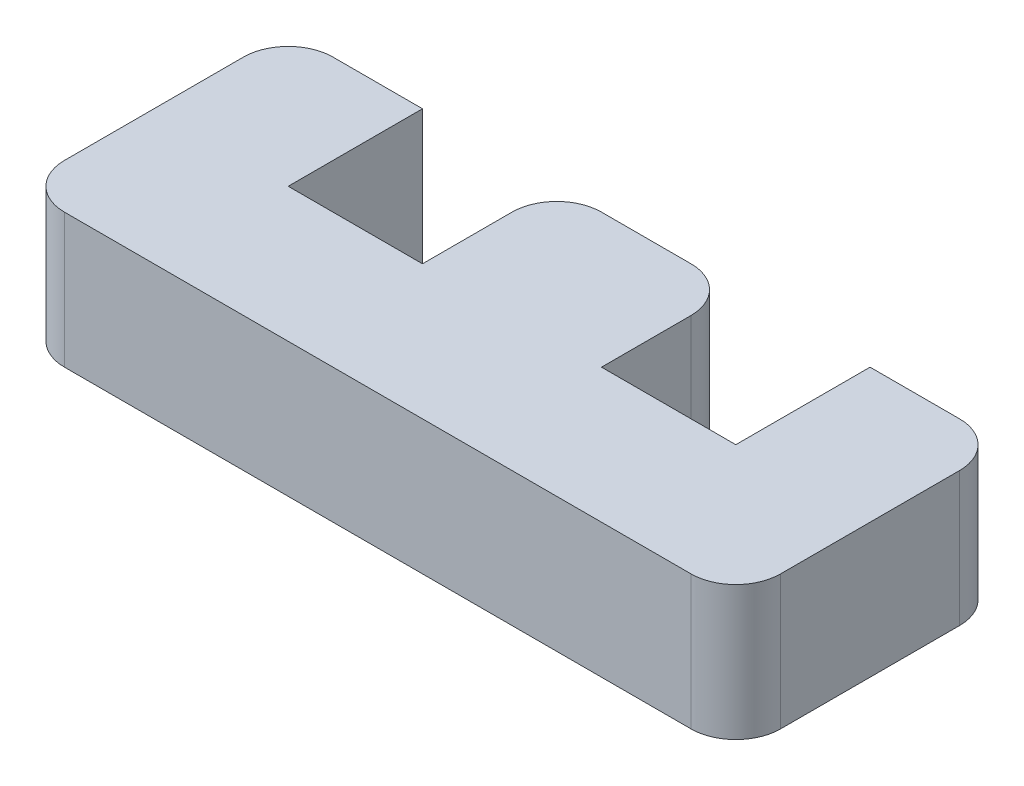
ISO-10303-21;
HEADER;
FILE_DESCRIPTION(('STEP AP214'),'2;1');
FILE_NAME('part.step','',(''),(''),'','','');
FILE_SCHEMA(('AUTOMOTIVE_DESIGN { 1 0 10303 214 1 1 1 1 }'));
ENDSEC;
DATA;
#1=APPLICATION_CONTEXT('core data for automotive mechanical design processes');
#2=APPLICATION_PROTOCOL_DEFINITION('international standard','automotive_design',2000,#1);
#3=PRODUCT_CONTEXT('',#1,'mechanical');
#4=PRODUCT('Part','Part','',(#3));
#5=PRODUCT_RELATED_PRODUCT_CATEGORY('part','',(#4));
#6=PRODUCT_DEFINITION_FORMATION('','',#4);
#7=PRODUCT_DEFINITION_CONTEXT('part definition',#1,'design');
#8=PRODUCT_DEFINITION('design','',#6,#7);
#9=PRODUCT_DEFINITION_SHAPE('','',#8);
#10=(LENGTH_UNIT() NAMED_UNIT(*) SI_UNIT(.MILLI.,.METRE.));
#11=(NAMED_UNIT(*) PLANE_ANGLE_UNIT() SI_UNIT($,.RADIAN.));
#12=(NAMED_UNIT(*) SI_UNIT($,.STERADIAN.) SOLID_ANGLE_UNIT());
#13=UNCERTAINTY_MEASURE_WITH_UNIT(LENGTH_MEASURE(1.E-05),#10,'distance_accuracy_value','');
#14=(GEOMETRIC_REPRESENTATION_CONTEXT(3) GLOBAL_UNCERTAINTY_ASSIGNED_CONTEXT((#13)) GLOBAL_UNIT_ASSIGNED_CONTEXT((#10,
#11,#12)) REPRESENTATION_CONTEXT('',''));
#15=CARTESIAN_POINT('',(0.,0.,0.));
#16=DIRECTION('',(0.,0.,1.));
#17=DIRECTION('',(1.,0.,0.));
#18=AXIS2_PLACEMENT_3D('',#15,#16,#17);
#19=CARTESIAN_POINT('',(3.,3.,0.));
#20=DIRECTION('',(0.,0.,1.));
#21=DIRECTION('',(1.,0.,0.));
#22=AXIS2_PLACEMENT_3D('',#19,#20,#21);
#23=PLANE('',#22);
#24=DIRECTION('',(-1.,0.,0.));
#25=VECTOR('',#24,1.);
#26=CARTESIAN_POINT('',(3.,0.,0.));
#27=LINE('',#26,#25);
#28=CARTESIAN_POINT('',(3.,0.,0.));
#29=VERTEX_POINT('',#28);
#30=CARTESIAN_POINT('',(1.,0.,0.));
#31=VERTEX_POINT('',#30);
#32=EDGE_CURVE('E196',#29,#31,#27,.T.);
#33=ORIENTED_EDGE('',*,*,#32,.T.);
#34=DIRECTION('',(0.,-1.,0.));
#35=VECTOR('',#34,1.);
#36=CARTESIAN_POINT('',(1.,3.,0.));
#37=LINE('',#36,#35);
#38=CARTESIAN_POINT('',(1.,3.,0.));
#39=VERTEX_POINT('',#38);
#40=EDGE_CURVE('E274',#31,#39,#37,.F.);
#41=ORIENTED_EDGE('',*,*,#40,.T.);
#42=DIRECTION('',(-1.,0.,0.));
#43=VECTOR('',#42,1.);
#44=CARTESIAN_POINT('',(3.,3.,0.));
#45=LINE('',#44,#43);
#46=CARTESIAN_POINT('',(3.,3.,0.));
#47=VERTEX_POINT('',#46);
#48=EDGE_CURVE('E225',#47,#39,#45,.T.);
#49=ORIENTED_EDGE('',*,*,#48,.F.);
#50=DIRECTION('',(0.,-1.,0.));
#51=VECTOR('',#50,1.);
#52=CARTESIAN_POINT('',(3.,3.,0.));
#53=LINE('',#52,#51);
#54=EDGE_CURVE('E195',#47,#29,#53,.T.);
#55=ORIENTED_EDGE('',*,*,#54,.T.);
#56=EDGE_LOOP('',(#33,#41,#49,#55));
#57=FACE_BOUND('',#56,.T.);
#58=ADVANCED_FACE('F33',(#57),#23,.F.);
#59=CARTESIAN_POINT('',(0.,3.,0.));
#60=DIRECTION('',(1.,0.,0.));
#61=DIRECTION('',(0.,0.,-1.));
#62=AXIS2_PLACEMENT_3D('',#59,#60,#61);
#63=PLANE('',#62);
#64=DIRECTION('',(0.,0.,1.));
#65=VECTOR('',#64,1.);
#66=CARTESIAN_POINT('',(0.,3.,0.));
#67=LINE('',#66,#65);
#68=CARTESIAN_POINT('',(0.,3.,1.));
#69=VERTEX_POINT('',#68);
#70=CARTESIAN_POINT('',(0.,3.,5.));
#71=VERTEX_POINT('',#70);
#72=EDGE_CURVE('E306',#69,#71,#67,.T.);
#73=ORIENTED_EDGE('',*,*,#72,.F.);
#74=DIRECTION('',(0.,-1.,0.));
#75=VECTOR('',#74,1.);
#76=CARTESIAN_POINT('',(0.,3.,1.));
#77=LINE('',#76,#75);
#78=CARTESIAN_POINT('',(0.,0.,1.));
#79=VERTEX_POINT('',#78);
#80=EDGE_CURVE('E271',#69,#79,#77,.T.);
#81=ORIENTED_EDGE('',*,*,#80,.T.);
#82=DIRECTION('',(0.,0.,1.));
#83=VECTOR('',#82,1.);
#84=CARTESIAN_POINT('',(0.,0.,0.));
#85=LINE('',#84,#83);
#86=CARTESIAN_POINT('',(0.,0.,5.));
#87=VERTEX_POINT('',#86);
#88=EDGE_CURVE('E199',#79,#87,#85,.T.);
#89=ORIENTED_EDGE('',*,*,#88,.T.);
#90=DIRECTION('',(0.,-1.,0.));
#91=VECTOR('',#90,1.);
#92=CARTESIAN_POINT('',(0.,3.,5.));
#93=LINE('',#92,#91);
#94=EDGE_CURVE('E269',#87,#71,#93,.F.);
#95=ORIENTED_EDGE('',*,*,#94,.T.);
#96=EDGE_LOOP('',(#73,#81,#89,#95));
#97=FACE_BOUND('',#96,.T.);
#98=ADVANCED_FACE('F323',(#97),#63,.F.);
#99=CARTESIAN_POINT('',(0.,3.,6.));
#100=DIRECTION('',(0.,0.,-1.));
#101=DIRECTION('',(-1.,0.,0.));
#102=AXIS2_PLACEMENT_3D('',#99,#100,#101);
#103=PLANE('',#102);
#104=DIRECTION('',(1.,0.,0.));
#105=VECTOR('',#104,1.);
#106=CARTESIAN_POINT('',(0.,0.,6.));
#107=LINE('',#106,#105);
#108=CARTESIAN_POINT('',(1.,0.,6.));
#109=VERTEX_POINT('',#108);
#110=CARTESIAN_POINT('',(15.,0.,6.));
#111=VERTEX_POINT('',#110);
#112=EDGE_CURVE('E202',#109,#111,#107,.T.);
#113=ORIENTED_EDGE('',*,*,#112,.T.);
#114=DIRECTION('',(0.,-1.,0.));
#115=VECTOR('',#114,1.);
#116=CARTESIAN_POINT('',(15.,3.,6.));
#117=LINE('',#116,#115);
#118=CARTESIAN_POINT('',(15.,3.,6.));
#119=VERTEX_POINT('',#118);
#120=EDGE_CURVE('E11',#111,#119,#117,.F.);
#121=ORIENTED_EDGE('',*,*,#120,.T.);
#122=DIRECTION('',(1.,0.,0.));
#123=VECTOR('',#122,1.);
#124=CARTESIAN_POINT('',(0.,3.,6.));
#125=LINE('',#124,#123);
#126=CARTESIAN_POINT('',(1.,3.,6.));
#127=VERTEX_POINT('',#126);
#128=EDGE_CURVE('E290',#127,#119,#125,.T.);
#129=ORIENTED_EDGE('',*,*,#128,.F.);
#130=DIRECTION('',(0.,-1.,0.));
#131=VECTOR('',#130,1.);
#132=CARTESIAN_POINT('',(1.,3.,6.));
#133=LINE('',#132,#131);
#134=EDGE_CURVE('E41',#127,#109,#133,.T.);
#135=ORIENTED_EDGE('',*,*,#134,.T.);
#136=EDGE_LOOP('',(#113,#121,#129,#135));
#137=FACE_BOUND('',#136,.T.);
#138=ADVANCED_FACE('F287',(#137),#103,.F.);
#139=CARTESIAN_POINT('',(16.,3.,6.));
#140=DIRECTION('',(-1.,0.,0.));
#141=DIRECTION('',(0.,0.,1.));
#142=AXIS2_PLACEMENT_3D('',#139,#140,#141);
#143=PLANE('',#142);
#144=DIRECTION('',(0.,0.,-1.));
#145=VECTOR('',#144,1.);
#146=CARTESIAN_POINT('',(16.,0.,6.));
#147=LINE('',#146,#145);
#148=CARTESIAN_POINT('',(16.,0.,5.));
#149=VERTEX_POINT('',#148);
#150=CARTESIAN_POINT('',(16.,0.,1.));
#151=VERTEX_POINT('',#150);
#152=EDGE_CURVE('E205',#149,#151,#147,.T.);
#153=ORIENTED_EDGE('',*,*,#152,.T.);
#154=DIRECTION('',(0.,-1.,0.));
#155=VECTOR('',#154,1.);
#156=CARTESIAN_POINT('',(16.,3.,1.));
#157=LINE('',#156,#155);
#158=CARTESIAN_POINT('',(16.,3.,1.));
#159=VERTEX_POINT('',#158);
#160=EDGE_CURVE('E281',#151,#159,#157,.F.);
#161=ORIENTED_EDGE('',*,*,#160,.T.);
#162=DIRECTION('',(0.,0.,-1.));
#163=VECTOR('',#162,1.);
#164=CARTESIAN_POINT('',(16.,3.,6.));
#165=LINE('',#164,#163);
#166=CARTESIAN_POINT('',(16.,3.,5.));
#167=VERTEX_POINT('',#166);
#168=EDGE_CURVE('E165',#167,#159,#165,.T.);
#169=ORIENTED_EDGE('',*,*,#168,.F.);
#170=DIRECTION('',(0.,-1.,0.));
#171=VECTOR('',#170,1.);
#172=CARTESIAN_POINT('',(16.,3.,5.));
#173=LINE('',#172,#171);
#174=EDGE_CURVE('E278',#167,#149,#173,.T.);
#175=ORIENTED_EDGE('',*,*,#174,.T.);
#176=EDGE_LOOP('',(#153,#161,#169,#175));
#177=FACE_BOUND('',#176,.T.);
#178=ADVANCED_FACE('F304',(#177),#143,.F.);
#179=CARTESIAN_POINT('',(16.,3.,0.));
#180=DIRECTION('',(0.,0.,1.));
#181=DIRECTION('',(1.,0.,0.));
#182=AXIS2_PLACEMENT_3D('',#179,#180,#181);
#183=PLANE('',#182);
#184=DIRECTION('',(-1.,0.,0.));
#185=VECTOR('',#184,1.);
#186=CARTESIAN_POINT('',(16.,3.,0.));
#187=LINE('',#186,#185);
#188=CARTESIAN_POINT('',(15.,3.,0.));
#189=VERTEX_POINT('',#188);
#190=CARTESIAN_POINT('',(13.,3.,0.));
#191=VERTEX_POINT('',#190);
#192=EDGE_CURVE('E155',#189,#191,#187,.T.);
#193=ORIENTED_EDGE('',*,*,#192,.F.);
#194=DIRECTION('',(0.,-1.,0.));
#195=VECTOR('',#194,1.);
#196=CARTESIAN_POINT('',(15.,3.,0.));
#197=LINE('',#196,#195);
#198=CARTESIAN_POINT('',(15.,0.,0.));
#199=VERTEX_POINT('',#198);
#200=EDGE_CURVE('E276',#189,#199,#197,.T.);
#201=ORIENTED_EDGE('',*,*,#200,.T.);
#202=DIRECTION('',(-1.,0.,0.));
#203=VECTOR('',#202,1.);
#204=CARTESIAN_POINT('',(16.,0.,0.));
#205=LINE('',#204,#203);
#206=CARTESIAN_POINT('',(13.,0.,0.));
#207=VERTEX_POINT('',#206);
#208=EDGE_CURVE('E171',#199,#207,#205,.T.);
#209=ORIENTED_EDGE('',*,*,#208,.T.);
#210=DIRECTION('',(0.,-1.,0.));
#211=VECTOR('',#210,1.);
#212=CARTESIAN_POINT('',(13.,3.,0.));
#213=LINE('',#212,#211);
#214=EDGE_CURVE('E168',#191,#207,#213,.T.);
#215=ORIENTED_EDGE('',*,*,#214,.F.);
#216=EDGE_LOOP('',(#193,#201,#209,#215));
#217=FACE_BOUND('',#216,.T.);
#218=ADVANCED_FACE('F169',(#217),#183,.F.);
#219=CARTESIAN_POINT('',(13.,3.,0.));
#220=DIRECTION('',(1.,0.,0.));
#221=DIRECTION('',(0.,0.,-1.));
#222=AXIS2_PLACEMENT_3D('',#219,#220,#221);
#223=PLANE('',#222);
#224=DIRECTION('',(0.,0.,1.));
#225=VECTOR('',#224,1.);
#226=CARTESIAN_POINT('',(13.,0.,0.));
#227=LINE('',#226,#225);
#228=CARTESIAN_POINT('',(13.,0.,3.));
#229=VERTEX_POINT('',#228);
#230=EDGE_CURVE('E209',#207,#229,#227,.T.);
#231=ORIENTED_EDGE('',*,*,#230,.T.);
#232=DIRECTION('',(0.,-1.,0.));
#233=VECTOR('',#232,1.);
#234=CARTESIAN_POINT('',(13.,3.,3.));
#235=LINE('',#234,#233);
#236=CARTESIAN_POINT('',(13.,3.,3.));
#237=VERTEX_POINT('',#236);
#238=EDGE_CURVE('E175',#237,#229,#235,.T.);
#239=ORIENTED_EDGE('',*,*,#238,.F.);
#240=DIRECTION('',(0.,0.,1.));
#241=VECTOR('',#240,1.);
#242=CARTESIAN_POINT('',(13.,3.,0.));
#243=LINE('',#242,#241);
#244=EDGE_CURVE('E160',#191,#237,#243,.T.);
#245=ORIENTED_EDGE('',*,*,#244,.F.);
#246=ORIENTED_EDGE('',*,*,#214,.T.);
#247=EDGE_LOOP('',(#231,#239,#245,#246));
#248=FACE_BOUND('',#247,.T.);
#249=ADVANCED_FACE('F177',(#248),#223,.F.);
#250=CARTESIAN_POINT('',(13.,3.,3.));
#251=DIRECTION('',(0.,0.,1.));
#252=DIRECTION('',(1.,0.,0.));
#253=AXIS2_PLACEMENT_3D('',#250,#251,#252);
#254=PLANE('',#253);
#255=DIRECTION('',(-1.,0.,0.));
#256=VECTOR('',#255,1.);
#257=CARTESIAN_POINT('',(13.,0.,3.));
#258=LINE('',#257,#256);
#259=CARTESIAN_POINT('',(10.,0.,3.));
#260=VERTEX_POINT('',#259);
#261=EDGE_CURVE('E211',#229,#260,#258,.T.);
#262=ORIENTED_EDGE('',*,*,#261,.T.);
#263=DIRECTION('',(0.,-1.,0.));
#264=VECTOR('',#263,1.);
#265=CARTESIAN_POINT('',(10.,3.,3.));
#266=LINE('',#265,#264);
#267=CARTESIAN_POINT('',(10.,3.,3.));
#268=VERTEX_POINT('',#267);
#269=EDGE_CURVE('E234',#268,#260,#266,.T.);
#270=ORIENTED_EDGE('',*,*,#269,.F.);
#271=DIRECTION('',(-1.,0.,0.));
#272=VECTOR('',#271,1.);
#273=CARTESIAN_POINT('',(13.,3.,3.));
#274=LINE('',#273,#272);
#275=EDGE_CURVE('E180',#237,#268,#274,.T.);
#276=ORIENTED_EDGE('',*,*,#275,.F.);
#277=ORIENTED_EDGE('',*,*,#238,.T.);
#278=EDGE_LOOP('',(#262,#270,#276,#277));
#279=FACE_BOUND('',#278,.T.);
#280=ADVANCED_FACE('F357',(#279),#254,.F.);
#281=CARTESIAN_POINT('',(10.,3.,3.));
#282=DIRECTION('',(-1.,0.,0.));
#283=DIRECTION('',(0.,0.,1.));
#284=AXIS2_PLACEMENT_3D('',#281,#282,#283);
#285=PLANE('',#284);
#286=DIRECTION('',(0.,0.,-1.));
#287=VECTOR('',#286,1.);
#288=CARTESIAN_POINT('',(10.,0.,3.));
#289=LINE('',#288,#287);
#290=CARTESIAN_POINT('',(10.,0.,1.));
#291=VERTEX_POINT('',#290);
#292=EDGE_CURVE('E213',#260,#291,#289,.T.);
#293=ORIENTED_EDGE('',*,*,#292,.T.);
#294=DIRECTION('',(0.,-1.,0.));
#295=VECTOR('',#294,1.);
#296=CARTESIAN_POINT('',(10.,3.,1.));
#297=LINE('',#296,#295);
#298=CARTESIAN_POINT('',(10.,3.,1.));
#299=VERTEX_POINT('',#298);
#300=EDGE_CURVE('E254',#291,#299,#297,.F.);
#301=ORIENTED_EDGE('',*,*,#300,.T.);
#302=DIRECTION('',(0.,0.,-1.));
#303=VECTOR('',#302,1.);
#304=CARTESIAN_POINT('',(10.,3.,3.));
#305=LINE('',#304,#303);
#306=EDGE_CURVE('E182',#268,#299,#305,.T.);
#307=ORIENTED_EDGE('',*,*,#306,.F.);
#308=ORIENTED_EDGE('',*,*,#269,.T.);
#309=EDGE_LOOP('',(#293,#301,#307,#308));
#310=FACE_BOUND('',#309,.T.);
#311=ADVANCED_FACE('F353',(#310),#285,.F.);
#312=CARTESIAN_POINT('',(10.,3.,0.));
#313=DIRECTION('',(0.,0.,1.));
#314=DIRECTION('',(1.,0.,0.));
#315=AXIS2_PLACEMENT_3D('',#312,#313,#314);
#316=PLANE('',#315);
#317=DIRECTION('',(-1.,0.,0.));
#318=VECTOR('',#317,1.);
#319=CARTESIAN_POINT('',(10.,3.,0.));
#320=LINE('',#319,#318);
#321=CARTESIAN_POINT('',(9.,3.,0.));
#322=VERTEX_POINT('',#321);
#323=CARTESIAN_POINT('',(7.,3.,0.));
#324=VERTEX_POINT('',#323);
#325=EDGE_CURVE('E187',#322,#324,#320,.T.);
#326=ORIENTED_EDGE('',*,*,#325,.F.);
#327=DIRECTION('',(0.,-1.,0.));
#328=VECTOR('',#327,1.);
#329=CARTESIAN_POINT('',(9.,3.,0.));
#330=LINE('',#329,#328);
#331=CARTESIAN_POINT('',(9.,0.,0.));
#332=VERTEX_POINT('',#331);
#333=EDGE_CURVE('E239',#322,#332,#330,.T.);
#334=ORIENTED_EDGE('',*,*,#333,.T.);
#335=DIRECTION('',(-1.,0.,0.));
#336=VECTOR('',#335,1.);
#337=CARTESIAN_POINT('',(10.,0.,0.));
#338=LINE('',#337,#336);
#339=CARTESIAN_POINT('',(7.,0.,0.));
#340=VERTEX_POINT('',#339);
#341=EDGE_CURVE('E216',#332,#340,#338,.T.);
#342=ORIENTED_EDGE('',*,*,#341,.T.);
#343=DIRECTION('',(0.,-1.,0.));
#344=VECTOR('',#343,1.);
#345=CARTESIAN_POINT('',(7.,3.,0.));
#346=LINE('',#345,#344);
#347=EDGE_CURVE('E174',#340,#324,#346,.F.);
#348=ORIENTED_EDGE('',*,*,#347,.T.);
#349=EDGE_LOOP('',(#326,#334,#342,#348));
#350=FACE_BOUND('',#349,.T.);
#351=ADVANCED_FACE('F344',(#350),#316,.F.);
#352=CARTESIAN_POINT('',(6.,3.,0.));
#353=DIRECTION('',(1.,0.,0.));
#354=DIRECTION('',(0.,0.,-1.));
#355=AXIS2_PLACEMENT_3D('',#352,#353,#354);
#356=PLANE('',#355);
#357=DIRECTION('',(0.,0.,1.));
#358=VECTOR('',#357,1.);
#359=CARTESIAN_POINT('',(6.,3.,0.));
#360=LINE('',#359,#358);
#361=CARTESIAN_POINT('',(6.,3.,1.));
#362=VERTEX_POINT('',#361);
#363=CARTESIAN_POINT('',(6.,3.,3.));
#364=VERTEX_POINT('',#363);
#365=EDGE_CURVE('E189',#362,#364,#360,.T.);
#366=ORIENTED_EDGE('',*,*,#365,.F.);
#367=DIRECTION('',(0.,-1.,0.));
#368=VECTOR('',#367,1.);
#369=CARTESIAN_POINT('',(6.,3.,1.));
#370=LINE('',#369,#368);
#371=CARTESIAN_POINT('',(6.,0.,1.));
#372=VERTEX_POINT('',#371);
#373=EDGE_CURVE('E266',#362,#372,#370,.T.);
#374=ORIENTED_EDGE('',*,*,#373,.T.);
#375=DIRECTION('',(0.,0.,1.));
#376=VECTOR('',#375,1.);
#377=CARTESIAN_POINT('',(6.,0.,0.));
#378=LINE('',#377,#376);
#379=CARTESIAN_POINT('',(6.,0.,3.));
#380=VERTEX_POINT('',#379);
#381=EDGE_CURVE('E219',#372,#380,#378,.T.);
#382=ORIENTED_EDGE('',*,*,#381,.T.);
#383=DIRECTION('',(0.,-1.,0.));
#384=VECTOR('',#383,1.);
#385=CARTESIAN_POINT('',(6.,3.,3.));
#386=LINE('',#385,#384);
#387=EDGE_CURVE('E231',#364,#380,#386,.T.);
#388=ORIENTED_EDGE('',*,*,#387,.F.);
#389=EDGE_LOOP('',(#366,#374,#382,#388));
#390=FACE_BOUND('',#389,.T.);
#391=ADVANCED_FACE('F337',(#390),#356,.F.);
#392=CARTESIAN_POINT('',(6.,3.,3.));
#393=DIRECTION('',(0.,0.,1.));
#394=DIRECTION('',(1.,0.,0.));
#395=AXIS2_PLACEMENT_3D('',#392,#393,#394);
#396=PLANE('',#395);
#397=DIRECTION('',(-1.,0.,0.));
#398=VECTOR('',#397,1.);
#399=CARTESIAN_POINT('',(6.,0.,3.));
#400=LINE('',#399,#398);
#401=CARTESIAN_POINT('',(3.,0.,3.));
#402=VERTEX_POINT('',#401);
#403=EDGE_CURVE('E221',#380,#402,#400,.T.);
#404=ORIENTED_EDGE('',*,*,#403,.T.);
#405=DIRECTION('',(0.,-1.,0.));
#406=VECTOR('',#405,1.);
#407=CARTESIAN_POINT('',(3.,3.,3.));
#408=LINE('',#407,#406);
#409=CARTESIAN_POINT('',(3.,3.,3.));
#410=VERTEX_POINT('',#409);
#411=EDGE_CURVE('E228',#410,#402,#408,.T.);
#412=ORIENTED_EDGE('',*,*,#411,.F.);
#413=DIRECTION('',(-1.,0.,0.));
#414=VECTOR('',#413,1.);
#415=CARTESIAN_POINT('',(6.,3.,3.));
#416=LINE('',#415,#414);
#417=EDGE_CURVE('E191',#364,#410,#416,.T.);
#418=ORIENTED_EDGE('',*,*,#417,.F.);
#419=ORIENTED_EDGE('',*,*,#387,.T.);
#420=EDGE_LOOP('',(#404,#412,#418,#419));
#421=FACE_BOUND('',#420,.T.);
#422=ADVANCED_FACE('F333',(#421),#396,.F.);
#423=CARTESIAN_POINT('',(3.,3.,3.));
#424=DIRECTION('',(-1.,0.,0.));
#425=DIRECTION('',(0.,0.,1.));
#426=AXIS2_PLACEMENT_3D('',#423,#424,#425);
#427=PLANE('',#426);
#428=DIRECTION('',(0.,0.,-1.));
#429=VECTOR('',#428,1.);
#430=CARTESIAN_POINT('',(3.,0.,3.));
#431=LINE('',#430,#429);
#432=EDGE_CURVE('E223',#402,#29,#431,.T.);
#433=ORIENTED_EDGE('',*,*,#432,.T.);
#434=ORIENTED_EDGE('',*,*,#54,.F.);
#435=DIRECTION('',(0.,0.,-1.));
#436=VECTOR('',#435,1.);
#437=CARTESIAN_POINT('',(3.,3.,3.));
#438=LINE('',#437,#436);
#439=EDGE_CURVE('E193',#410,#47,#438,.T.);
#440=ORIENTED_EDGE('',*,*,#439,.F.);
#441=ORIENTED_EDGE('',*,*,#411,.T.);
#442=EDGE_LOOP('',(#433,#434,#440,#441));
#443=FACE_BOUND('',#442,.T.);
#444=ADVANCED_FACE('F328',(#443),#427,.F.);
#445=CARTESIAN_POINT('',(0.,3.,0.));
#446=DIRECTION('',(0.,1.,0.));
#447=DIRECTION('',(0.,0.,1.));
#448=AXIS2_PLACEMENT_3D('',#445,#446,#447);
#449=PLANE('',#448);
#450=ORIENTED_EDGE('',*,*,#306,.T.);
#451=CARTESIAN_POINT('',(9.,3.,1.));
#452=DIRECTION('',(0.,1.,0.));
#453=DIRECTION('',(0.,0.,1.));
#454=AXIS2_PLACEMENT_3D('',#451,#452,#453);
#455=CIRCLE('',#454,1.);
#456=EDGE_CURVE('E264',#299,#322,#455,.T.);
#457=ORIENTED_EDGE('',*,*,#456,.T.);
#458=ORIENTED_EDGE('',*,*,#325,.T.);
#459=CARTESIAN_POINT('',(7.,3.,1.));
#460=DIRECTION('',(0.,1.,0.));
#461=DIRECTION('',(0.,0.,1.));
#462=AXIS2_PLACEMENT_3D('',#459,#460,#461);
#463=CIRCLE('',#462,1.);
#464=EDGE_CURVE('E48',#324,#362,#463,.T.);
#465=ORIENTED_EDGE('',*,*,#464,.T.);
#466=ORIENTED_EDGE('',*,*,#365,.T.);
#467=ORIENTED_EDGE('',*,*,#417,.T.);
#468=ORIENTED_EDGE('',*,*,#439,.T.);
#469=ORIENTED_EDGE('',*,*,#48,.T.);
#470=CARTESIAN_POINT('',(1.,3.,1.));
#471=DIRECTION('',(0.,1.,0.));
#472=DIRECTION('',(0.,0.,1.));
#473=AXIS2_PLACEMENT_3D('',#470,#471,#472);
#474=CIRCLE('',#473,1.);
#475=EDGE_CURVE('E261',#39,#69,#474,.T.);
#476=ORIENTED_EDGE('',*,*,#475,.T.);
#477=ORIENTED_EDGE('',*,*,#72,.T.);
#478=CARTESIAN_POINT('',(1.,3.,5.));
#479=DIRECTION('',(0.,1.,0.));
#480=DIRECTION('',(0.,0.,1.));
#481=AXIS2_PLACEMENT_3D('',#478,#479,#480);
#482=CIRCLE('',#481,1.);
#483=EDGE_CURVE('E256',#71,#127,#482,.T.);
#484=ORIENTED_EDGE('',*,*,#483,.T.);
#485=ORIENTED_EDGE('',*,*,#128,.T.);
#486=CARTESIAN_POINT('',(15.,3.,5.));
#487=DIRECTION('',(0.,1.,0.));
#488=DIRECTION('',(0.,0.,1.));
#489=AXIS2_PLACEMENT_3D('',#486,#487,#488);
#490=CIRCLE('',#489,1.);
#491=EDGE_CURVE('E258',#119,#167,#490,.T.);
#492=ORIENTED_EDGE('',*,*,#491,.T.);
#493=ORIENTED_EDGE('',*,*,#168,.T.);
#494=CARTESIAN_POINT('',(15.,3.,1.));
#495=DIRECTION('',(0.,1.,0.));
#496=DIRECTION('',(0.,0.,1.));
#497=AXIS2_PLACEMENT_3D('',#494,#495,#496);
#498=CIRCLE('',#497,1.);
#499=EDGE_CURVE('E55',#159,#189,#498,.T.);
#500=ORIENTED_EDGE('',*,*,#499,.T.);
#501=ORIENTED_EDGE('',*,*,#192,.T.);
#502=ORIENTED_EDGE('',*,*,#244,.T.);
#503=ORIENTED_EDGE('',*,*,#275,.T.);
#504=EDGE_LOOP('',(#450,#457,#458,#465,#466,#467,#468,#469,#476,#477,#484,#485,#492,#493,#500,
#501,#502,#503));
#505=FACE_BOUND('',#504,.T.);
#506=ADVANCED_FACE('F158',(#505),#449,.T.);
#507=CARTESIAN_POINT('',(0.,0.,0.));
#508=DIRECTION('',(0.,1.,0.));
#509=DIRECTION('',(0.,0.,1.));
#510=AXIS2_PLACEMENT_3D('',#507,#508,#509);
#511=PLANE('',#510);
#512=ORIENTED_EDGE('',*,*,#341,.F.);
#513=CARTESIAN_POINT('',(9.,0.,1.));
#514=DIRECTION('',(0.,1.,0.));
#515=DIRECTION('',(0.,0.,1.));
#516=AXIS2_PLACEMENT_3D('',#513,#514,#515);
#517=CIRCLE('',#516,1.);
#518=EDGE_CURVE('E252',#332,#291,#517,.F.);
#519=ORIENTED_EDGE('',*,*,#518,.T.);
#520=ORIENTED_EDGE('',*,*,#292,.F.);
#521=ORIENTED_EDGE('',*,*,#261,.F.);
#522=ORIENTED_EDGE('',*,*,#230,.F.);
#523=ORIENTED_EDGE('',*,*,#208,.F.);
#524=CARTESIAN_POINT('',(15.,0.,1.));
#525=DIRECTION('',(0.,1.,0.));
#526=DIRECTION('',(0.,0.,1.));
#527=AXIS2_PLACEMENT_3D('',#524,#525,#526);
#528=CIRCLE('',#527,1.);
#529=EDGE_CURVE('E246',#199,#151,#528,.F.);
#530=ORIENTED_EDGE('',*,*,#529,.T.);
#531=ORIENTED_EDGE('',*,*,#152,.F.);
#532=CARTESIAN_POINT('',(15.,0.,5.));
#533=DIRECTION('',(0.,1.,0.));
#534=DIRECTION('',(0.,0.,1.));
#535=AXIS2_PLACEMENT_3D('',#532,#533,#534);
#536=CIRCLE('',#535,1.);
#537=EDGE_CURVE('E244',#149,#111,#536,.F.);
#538=ORIENTED_EDGE('',*,*,#537,.T.);
#539=ORIENTED_EDGE('',*,*,#112,.F.);
#540=CARTESIAN_POINT('',(1.,0.,5.));
#541=DIRECTION('',(0.,1.,0.));
#542=DIRECTION('',(0.,0.,1.));
#543=AXIS2_PLACEMENT_3D('',#540,#541,#542);
#544=CIRCLE('',#543,1.);
#545=EDGE_CURVE('E242',#109,#87,#544,.F.);
#546=ORIENTED_EDGE('',*,*,#545,.T.);
#547=ORIENTED_EDGE('',*,*,#88,.F.);
#548=CARTESIAN_POINT('',(1.,0.,1.));
#549=DIRECTION('',(0.,1.,0.));
#550=DIRECTION('',(0.,0.,1.));
#551=AXIS2_PLACEMENT_3D('',#548,#549,#550);
#552=CIRCLE('',#551,1.);
#553=EDGE_CURVE('E248',#79,#31,#552,.F.);
#554=ORIENTED_EDGE('',*,*,#553,.T.);
#555=ORIENTED_EDGE('',*,*,#32,.F.);
#556=ORIENTED_EDGE('',*,*,#432,.F.);
#557=ORIENTED_EDGE('',*,*,#403,.F.);
#558=ORIENTED_EDGE('',*,*,#381,.F.);
#559=CARTESIAN_POINT('',(7.,0.,1.));
#560=DIRECTION('',(0.,1.,0.));
#561=DIRECTION('',(0.,0.,1.));
#562=AXIS2_PLACEMENT_3D('',#559,#560,#561);
#563=CIRCLE('',#562,1.);
#564=EDGE_CURVE('E250',#372,#340,#563,.F.);
#565=ORIENTED_EDGE('',*,*,#564,.T.);
#566=EDGE_LOOP('',(#512,#519,#520,#521,#522,#523,#530,#531,#538,#539,#546,#547,#554,#555,#556,
#557,#558,#565));
#567=FACE_BOUND('',#566,.T.);
#568=ADVANCED_FACE('F295',(#567),#511,.F.);
#569=CARTESIAN_POINT('',(9.,3.,1.));
#570=DIRECTION('',(0.,-1.,0.));
#571=DIRECTION('',(0.,0.,-1.));
#572=AXIS2_PLACEMENT_3D('',#569,#570,#571);
#573=CYLINDRICAL_SURFACE('',#572,1.);
#574=ORIENTED_EDGE('',*,*,#456,.F.);
#575=ORIENTED_EDGE('',*,*,#300,.F.);
#576=ORIENTED_EDGE('',*,*,#518,.F.);
#577=ORIENTED_EDGE('',*,*,#333,.F.);
#578=EDGE_LOOP('',(#574,#575,#576,#577));
#579=FACE_BOUND('',#578,.T.);
#580=ADVANCED_FACE('F348',(#579),#573,.T.);
#581=CARTESIAN_POINT('',(7.,3.,1.));
#582=DIRECTION('',(0.,-1.,0.));
#583=DIRECTION('',(0.,0.,-1.));
#584=AXIS2_PLACEMENT_3D('',#581,#582,#583);
#585=CYLINDRICAL_SURFACE('',#584,1.);
#586=ORIENTED_EDGE('',*,*,#464,.F.);
#587=ORIENTED_EDGE('',*,*,#347,.F.);
#588=ORIENTED_EDGE('',*,*,#564,.F.);
#589=ORIENTED_EDGE('',*,*,#373,.F.);
#590=EDGE_LOOP('',(#586,#587,#588,#589));
#591=FACE_BOUND('',#590,.T.);
#592=ADVANCED_FACE('F340',(#591),#585,.T.);
#593=CARTESIAN_POINT('',(1.,3.,1.));
#594=DIRECTION('',(0.,-1.,0.));
#595=DIRECTION('',(0.,0.,-1.));
#596=AXIS2_PLACEMENT_3D('',#593,#594,#595);
#597=CYLINDRICAL_SURFACE('',#596,1.);
#598=ORIENTED_EDGE('',*,*,#475,.F.);
#599=ORIENTED_EDGE('',*,*,#40,.F.);
#600=ORIENTED_EDGE('',*,*,#553,.F.);
#601=ORIENTED_EDGE('',*,*,#80,.F.);
#602=EDGE_LOOP('',(#598,#599,#600,#601));
#603=FACE_BOUND('',#602,.T.);
#604=ADVANCED_FACE('F321',(#603),#597,.T.);
#605=CARTESIAN_POINT('',(15.,3.,1.));
#606=DIRECTION('',(0.,-1.,0.));
#607=DIRECTION('',(0.,0.,-1.));
#608=AXIS2_PLACEMENT_3D('',#605,#606,#607);
#609=CYLINDRICAL_SURFACE('',#608,1.);
#610=ORIENTED_EDGE('',*,*,#499,.F.);
#611=ORIENTED_EDGE('',*,*,#160,.F.);
#612=ORIENTED_EDGE('',*,*,#529,.F.);
#613=ORIENTED_EDGE('',*,*,#200,.F.);
#614=EDGE_LOOP('',(#610,#611,#612,#613));
#615=FACE_BOUND('',#614,.T.);
#616=ADVANCED_FACE('F359',(#615),#609,.T.);
#617=CARTESIAN_POINT('',(15.,3.,5.));
#618=DIRECTION('',(0.,-1.,0.));
#619=DIRECTION('',(0.,0.,-1.));
#620=AXIS2_PLACEMENT_3D('',#617,#618,#619);
#621=CYLINDRICAL_SURFACE('',#620,1.);
#622=ORIENTED_EDGE('',*,*,#491,.F.);
#623=ORIENTED_EDGE('',*,*,#120,.F.);
#624=ORIENTED_EDGE('',*,*,#537,.F.);
#625=ORIENTED_EDGE('',*,*,#174,.F.);
#626=EDGE_LOOP('',(#622,#623,#624,#625));
#627=FACE_BOUND('',#626,.T.);
#628=ADVANCED_FACE('F301',(#627),#621,.T.);
#629=CARTESIAN_POINT('',(1.,3.,5.));
#630=DIRECTION('',(0.,-1.,0.));
#631=DIRECTION('',(0.,0.,-1.));
#632=AXIS2_PLACEMENT_3D('',#629,#630,#631);
#633=CYLINDRICAL_SURFACE('',#632,1.);
#634=ORIENTED_EDGE('',*,*,#483,.F.);
#635=ORIENTED_EDGE('',*,*,#94,.F.);
#636=ORIENTED_EDGE('',*,*,#545,.F.);
#637=ORIENTED_EDGE('',*,*,#134,.F.);
#638=EDGE_LOOP('',(#634,#635,#636,#637));
#639=FACE_BOUND('',#638,.T.);
#640=ADVANCED_FACE('F35',(#639),#633,.T.);
#641=CLOSED_SHELL('',(#58,#98,#138,#178,#218,#249,#280,#311,#351,#391,#422,#444,#506,#568,#580,
#592,#604,#616,#628,#640));
#642=MANIFOLD_SOLID_BREP('B2',#641);
#643=ADVANCED_BREP_SHAPE_REPRESENTATION('',(#18,#642),#14);
#644=SHAPE_DEFINITION_REPRESENTATION(#9,#643);
ENDSEC;
END-ISO-10303-21;
